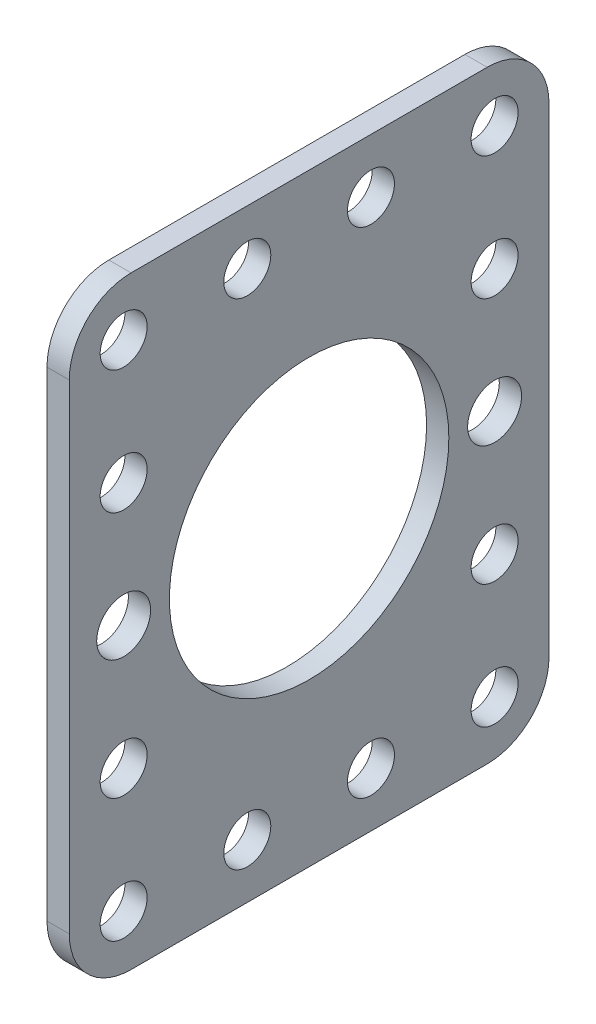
ISO-10303-21;
HEADER;
FILE_DESCRIPTION(('STEP AP214'),'2;1');
FILE_NAME('part.step','',(''),(''),'','','');
FILE_SCHEMA(('AUTOMOTIVE_DESIGN { 1 0 10303 214 1 1 1 1 }'));
ENDSEC;
DATA;
#1=APPLICATION_CONTEXT('core data for automotive mechanical design processes');
#2=APPLICATION_PROTOCOL_DEFINITION('international standard','automotive_design',2000,#1);
#3=PRODUCT_CONTEXT('',#1,'mechanical');
#4=PRODUCT('Part','Part','',(#3));
#5=PRODUCT_RELATED_PRODUCT_CATEGORY('part','',(#4));
#6=PRODUCT_DEFINITION_FORMATION('','',#4);
#7=PRODUCT_DEFINITION_CONTEXT('part definition',#1,'design');
#8=PRODUCT_DEFINITION('design','',#6,#7);
#9=PRODUCT_DEFINITION_SHAPE('','',#8);
#10=(LENGTH_UNIT() NAMED_UNIT(*) SI_UNIT(.MILLI.,.METRE.));
#11=(NAMED_UNIT(*) PLANE_ANGLE_UNIT() SI_UNIT($,.RADIAN.));
#12=(NAMED_UNIT(*) SI_UNIT($,.STERADIAN.) SOLID_ANGLE_UNIT());
#13=UNCERTAINTY_MEASURE_WITH_UNIT(LENGTH_MEASURE(1.E-05),#10,'distance_accuracy_value','');
#14=(GEOMETRIC_REPRESENTATION_CONTEXT(3) GLOBAL_UNCERTAINTY_ASSIGNED_CONTEXT((#13)) GLOBAL_UNIT_ASSIGNED_CONTEXT((#10,
#11,#12)) REPRESENTATION_CONTEXT('',''));
#15=CARTESIAN_POINT('',(0.,0.,0.));
#16=DIRECTION('',(0.,0.,1.));
#17=DIRECTION('',(1.,0.,0.));
#18=AXIS2_PLACEMENT_3D('',#15,#16,#17);
#19=CARTESIAN_POINT('',(2.28600000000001,-24.638,-18.288));
#20=DIRECTION('',(1.,0.,0.));
#21=DIRECTION('',(0.,0.,-1.));
#22=AXIS2_PLACEMENT_3D('',#19,#20,#21);
#23=PLANE('',#22);
#24=CARTESIAN_POINT('',(2.28599999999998,0.,19.05));
#25=DIRECTION('',(1.,0.,0.));
#26=DIRECTION('',(0.,0.,1.));
#27=AXIS2_PLACEMENT_3D('',#24,#25,#26);
#28=CIRCLE('',#27,2.7686);
#29=CARTESIAN_POINT('',(2.28599999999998,0.,21.8186));
#30=VERTEX_POINT('',#29);
#31=EDGE_CURVE('E268',#30,#30,#28,.T.);
#32=ORIENTED_EDGE('',*,*,#31,.F.);
#33=EDGE_LOOP('',(#32));
#34=FACE_BOUND('',#33,.T.);
#35=CARTESIAN_POINT('',(2.28600000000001,0.,-19.05));
#36=DIRECTION('',(1.,0.,0.));
#37=DIRECTION('',(0.,0.,-1.));
#38=AXIS2_PLACEMENT_3D('',#35,#36,#37);
#39=CIRCLE('',#38,2.7686);
#40=CARTESIAN_POINT('',(2.28600000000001,0.,-21.8186));
#41=VERTEX_POINT('',#40);
#42=EDGE_CURVE('E270',#41,#41,#39,.T.);
#43=ORIENTED_EDGE('',*,*,#42,.F.);
#44=EDGE_LOOP('',(#43));
#45=FACE_BOUND('',#44,.T.);
#46=CARTESIAN_POINT('',(2.28600000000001,25.4,-19.05));
#47=DIRECTION('',(1.,0.,0.));
#48=DIRECTION('',(0.,0.,-1.));
#49=AXIS2_PLACEMENT_3D('',#46,#47,#48);
#50=CIRCLE('',#49,2.413);
#51=CARTESIAN_POINT('',(2.28600000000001,25.4,-21.463));
#52=VERTEX_POINT('',#51);
#53=EDGE_CURVE('E281',#52,#52,#50,.T.);
#54=ORIENTED_EDGE('',*,*,#53,.F.);
#55=EDGE_LOOP('',(#54));
#56=FACE_BOUND('',#55,.T.);
#57=CARTESIAN_POINT('',(2.28599999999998,25.4,-6.35));
#58=DIRECTION('',(1.,0.,0.));
#59=DIRECTION('',(0.,0.,-1.));
#60=AXIS2_PLACEMENT_3D('',#57,#58,#59);
#61=CIRCLE('',#60,2.413);
#62=CARTESIAN_POINT('',(2.28599999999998,25.4,-8.763));
#63=VERTEX_POINT('',#62);
#64=EDGE_CURVE('E287',#63,#63,#61,.T.);
#65=ORIENTED_EDGE('',*,*,#64,.F.);
#66=EDGE_LOOP('',(#65));
#67=FACE_BOUND('',#66,.T.);
#68=CARTESIAN_POINT('',(2.28599999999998,25.4,6.35));
#69=DIRECTION('',(1.,0.,0.));
#70=DIRECTION('',(0.,0.,-1.));
#71=AXIS2_PLACEMENT_3D('',#68,#69,#70);
#72=CIRCLE('',#71,2.413);
#73=CARTESIAN_POINT('',(2.28599999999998,25.4,3.937));
#74=VERTEX_POINT('',#73);
#75=EDGE_CURVE('E293',#74,#74,#72,.T.);
#76=ORIENTED_EDGE('',*,*,#75,.F.);
#77=EDGE_LOOP('',(#76));
#78=FACE_BOUND('',#77,.T.);
#79=CARTESIAN_POINT('',(2.28600000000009,25.4,19.05));
#80=DIRECTION('',(1.,0.,0.));
#81=DIRECTION('',(0.,0.,-1.));
#82=AXIS2_PLACEMENT_3D('',#79,#80,#81);
#83=CIRCLE('',#82,2.413);
#84=CARTESIAN_POINT('',(2.28600000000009,25.4,16.637));
#85=VERTEX_POINT('',#84);
#86=EDGE_CURVE('E299',#85,#85,#83,.T.);
#87=ORIENTED_EDGE('',*,*,#86,.F.);
#88=EDGE_LOOP('',(#87));
#89=FACE_BOUND('',#88,.T.);
#90=CARTESIAN_POINT('',(2.28600000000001,12.7,-19.05));
#91=DIRECTION('',(1.,0.,0.));
#92=DIRECTION('',(0.,0.,-1.));
#93=AXIS2_PLACEMENT_3D('',#90,#91,#92);
#94=CIRCLE('',#93,2.413);
#95=CARTESIAN_POINT('',(2.28600000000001,12.7,-21.463));
#96=VERTEX_POINT('',#95);
#97=EDGE_CURVE('E305',#96,#96,#94,.T.);
#98=ORIENTED_EDGE('',*,*,#97,.F.);
#99=EDGE_LOOP('',(#98));
#100=FACE_BOUND('',#99,.T.);
#101=CARTESIAN_POINT('',(2.28599999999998,12.7,19.05));
#102=DIRECTION('',(1.,0.,0.));
#103=DIRECTION('',(0.,0.,-1.));
#104=AXIS2_PLACEMENT_3D('',#101,#102,#103);
#105=CIRCLE('',#104,2.413);
#106=CARTESIAN_POINT('',(2.28599999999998,12.7,16.637));
#107=VERTEX_POINT('',#106);
#108=EDGE_CURVE('E311',#107,#107,#105,.T.);
#109=ORIENTED_EDGE('',*,*,#108,.F.);
#110=EDGE_LOOP('',(#109));
#111=FACE_BOUND('',#110,.T.);
#112=CARTESIAN_POINT('',(2.28600000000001,-12.7,-19.05));
#113=DIRECTION('',(1.,0.,0.));
#114=DIRECTION('',(0.,0.,-1.));
#115=AXIS2_PLACEMENT_3D('',#112,#113,#114);
#116=CIRCLE('',#115,2.413);
#117=CARTESIAN_POINT('',(2.28600000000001,-12.7,-21.463));
#118=VERTEX_POINT('',#117);
#119=EDGE_CURVE('E317',#118,#118,#116,.T.);
#120=ORIENTED_EDGE('',*,*,#119,.F.);
#121=EDGE_LOOP('',(#120));
#122=FACE_BOUND('',#121,.T.);
#123=CARTESIAN_POINT('',(2.28600000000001,-12.7,19.05));
#124=DIRECTION('',(1.,0.,0.));
#125=DIRECTION('',(0.,0.,-1.));
#126=AXIS2_PLACEMENT_3D('',#123,#124,#125);
#127=CIRCLE('',#126,2.413);
#128=CARTESIAN_POINT('',(2.28600000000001,-12.7,16.637));
#129=VERTEX_POINT('',#128);
#130=EDGE_CURVE('E323',#129,#129,#127,.T.);
#131=ORIENTED_EDGE('',*,*,#130,.F.);
#132=EDGE_LOOP('',(#131));
#133=FACE_BOUND('',#132,.T.);
#134=CARTESIAN_POINT('',(2.28600000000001,-25.4,-19.05));
#135=DIRECTION('',(1.,0.,0.));
#136=DIRECTION('',(0.,0.,-1.));
#137=AXIS2_PLACEMENT_3D('',#134,#135,#136);
#138=CIRCLE('',#137,2.413);
#139=CARTESIAN_POINT('',(2.28600000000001,-25.4,-21.463));
#140=VERTEX_POINT('',#139);
#141=EDGE_CURVE('E329',#140,#140,#138,.T.);
#142=ORIENTED_EDGE('',*,*,#141,.F.);
#143=EDGE_LOOP('',(#142));
#144=FACE_BOUND('',#143,.T.);
#145=CARTESIAN_POINT('',(2.28600000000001,-25.4,-6.35));
#146=DIRECTION('',(1.,0.,0.));
#147=DIRECTION('',(0.,0.,-1.));
#148=AXIS2_PLACEMENT_3D('',#145,#146,#147);
#149=CIRCLE('',#148,2.413);
#150=CARTESIAN_POINT('',(2.28600000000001,-25.4,-8.763));
#151=VERTEX_POINT('',#150);
#152=EDGE_CURVE('E335',#151,#151,#149,.T.);
#153=ORIENTED_EDGE('',*,*,#152,.F.);
#154=EDGE_LOOP('',(#153));
#155=FACE_BOUND('',#154,.T.);
#156=CARTESIAN_POINT('',(2.28600000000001,-25.4,6.35));
#157=DIRECTION('',(1.,0.,0.));
#158=DIRECTION('',(0.,0.,-1.));
#159=AXIS2_PLACEMENT_3D('',#156,#157,#158);
#160=CIRCLE('',#159,2.413);
#161=CARTESIAN_POINT('',(2.28600000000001,-25.4,3.937));
#162=VERTEX_POINT('',#161);
#163=EDGE_CURVE('E341',#162,#162,#160,.T.);
#164=ORIENTED_EDGE('',*,*,#163,.F.);
#165=EDGE_LOOP('',(#164));
#166=FACE_BOUND('',#165,.T.);
#167=CARTESIAN_POINT('',(2.28600000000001,-25.4,19.05));
#168=DIRECTION('',(1.,0.,0.));
#169=DIRECTION('',(0.,0.,-1.));
#170=AXIS2_PLACEMENT_3D('',#167,#168,#169);
#171=CIRCLE('',#170,2.413);
#172=CARTESIAN_POINT('',(2.28600000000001,-25.4,16.637));
#173=VERTEX_POINT('',#172);
#174=EDGE_CURVE('E344',#173,#173,#171,.T.);
#175=ORIENTED_EDGE('',*,*,#174,.F.);
#176=EDGE_LOOP('',(#175));
#177=FACE_BOUND('',#176,.T.);
#178=CARTESIAN_POINT('',(2.28600000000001,-24.638,-18.288));
#179=DIRECTION('',(1.,0.,0.));
#180=DIRECTION('',(0.,0.,-1.));
#181=AXIS2_PLACEMENT_3D('',#178,#179,#180);
#182=CIRCLE('',#181,6.35);
#183=CARTESIAN_POINT('',(2.28600000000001,-30.988,-18.288));
#184=VERTEX_POINT('',#183);
#185=CARTESIAN_POINT('',(2.28600000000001,-24.638,-24.638));
#186=VERTEX_POINT('',#185);
#187=EDGE_CURVE('E133',#184,#186,#182,.T.);
#188=ORIENTED_EDGE('',*,*,#187,.T.);
#189=DIRECTION('',(0.,1.,0.));
#190=VECTOR('',#189,1.);
#191=CARTESIAN_POINT('',(2.28600000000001,-24.638,-24.638));
#192=LINE('',#191,#190);
#193=CARTESIAN_POINT('',(2.28600000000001,24.638,-24.638));
#194=VERTEX_POINT('',#193);
#195=EDGE_CURVE('E110',#186,#194,#192,.T.);
#196=ORIENTED_EDGE('',*,*,#195,.T.);
#197=CARTESIAN_POINT('',(2.28600000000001,24.638,-18.288));
#198=DIRECTION('',(1.,0.,0.));
#199=DIRECTION('',(0.,0.,1.));
#200=AXIS2_PLACEMENT_3D('',#197,#198,#199);
#201=CIRCLE('',#200,6.35);
#202=CARTESIAN_POINT('',(2.28599999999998,30.988,-18.288));
#203=VERTEX_POINT('',#202);
#204=EDGE_CURVE('E136',#194,#203,#201,.T.);
#205=ORIENTED_EDGE('',*,*,#204,.T.);
#206=DIRECTION('',(0.,0.,1.));
#207=VECTOR('',#206,1.);
#208=CARTESIAN_POINT('',(2.28600000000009,30.988,18.288));
#209=LINE('',#208,#207);
#210=CARTESIAN_POINT('',(2.28600000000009,30.988,18.288));
#211=VERTEX_POINT('',#210);
#212=EDGE_CURVE('E138',#203,#211,#209,.T.);
#213=ORIENTED_EDGE('',*,*,#212,.T.);
#214=CARTESIAN_POINT('',(2.28600000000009,24.638,18.288));
#215=DIRECTION('',(1.,0.,0.));
#216=DIRECTION('',(0.,0.,1.));
#217=AXIS2_PLACEMENT_3D('',#214,#215,#216);
#218=CIRCLE('',#217,6.35);
#219=CARTESIAN_POINT('',(2.28600000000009,24.638,24.638));
#220=VERTEX_POINT('',#219);
#221=EDGE_CURVE('E140',#211,#220,#218,.T.);
#222=ORIENTED_EDGE('',*,*,#221,.T.);
#223=DIRECTION('',(0.,-1.,0.));
#224=VECTOR('',#223,1.);
#225=CARTESIAN_POINT('',(2.28600000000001,-24.638,24.638));
#226=LINE('',#225,#224);
#227=CARTESIAN_POINT('',(2.28600000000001,-24.638,24.638));
#228=VERTEX_POINT('',#227);
#229=EDGE_CURVE('E142',#220,#228,#226,.T.);
#230=ORIENTED_EDGE('',*,*,#229,.T.);
#231=CARTESIAN_POINT('',(2.28600000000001,-24.638,18.288));
#232=DIRECTION('',(1.,0.,0.));
#233=DIRECTION('',(0.,0.,1.));
#234=AXIS2_PLACEMENT_3D('',#231,#232,#233);
#235=CIRCLE('',#234,6.35);
#236=CARTESIAN_POINT('',(2.28600000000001,-30.988,18.288));
#237=VERTEX_POINT('',#236);
#238=EDGE_CURVE('E51',#228,#237,#235,.T.);
#239=ORIENTED_EDGE('',*,*,#238,.T.);
#240=DIRECTION('',(0.,0.,-1.));
#241=VECTOR('',#240,1.);
#242=CARTESIAN_POINT('',(2.28600000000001,-30.988,18.288));
#243=LINE('',#242,#241);
#244=EDGE_CURVE('E46',#237,#184,#243,.T.);
#245=ORIENTED_EDGE('',*,*,#244,.T.);
#246=EDGE_LOOP('',(#188,#196,#205,#213,#222,#230,#239,#245));
#247=FACE_BOUND('',#246,.T.);
#248=CARTESIAN_POINT('',(2.28600000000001,0.,0.));
#249=DIRECTION('',(1.,0.,0.));
#250=DIRECTION('',(0.,0.,-1.));
#251=AXIS2_PLACEMENT_3D('',#248,#249,#250);
#252=CIRCLE('',#251,14.351);
#253=CARTESIAN_POINT('',(2.28600000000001,0.,-14.351));
#254=VERTEX_POINT('',#253);
#255=EDGE_CURVE('E115',#254,#254,#252,.T.);
#256=ORIENTED_EDGE('',*,*,#255,.F.);
#257=EDGE_LOOP('',(#256));
#258=FACE_BOUND('',#257,.T.);
#259=ADVANCED_FACE('F31',(#34,#45,#56,#67,#78,#89,#100,#111,#122,#133,#144,#155,#166,#177,#247,
#258),#23,.T.);
#260=CARTESIAN_POINT('',(0.,-24.638,-18.288));
#261=DIRECTION('',(1.,0.,0.));
#262=DIRECTION('',(0.,0.,-1.));
#263=AXIS2_PLACEMENT_3D('',#260,#261,#262);
#264=PLANE('',#263);
#265=CARTESIAN_POINT('',(0.,0.,19.05));
#266=DIRECTION('',(1.,0.,0.));
#267=DIRECTION('',(0.,0.,1.));
#268=AXIS2_PLACEMENT_3D('',#265,#266,#267);
#269=CIRCLE('',#268,2.7686);
#270=CARTESIAN_POINT('',(0.,0.,21.8186));
#271=VERTEX_POINT('',#270);
#272=EDGE_CURVE('E266',#271,#271,#269,.T.);
#273=ORIENTED_EDGE('',*,*,#272,.T.);
#274=EDGE_LOOP('',(#273));
#275=FACE_BOUND('',#274,.T.);
#276=CARTESIAN_POINT('',(0.,0.,-19.05));
#277=DIRECTION('',(1.,0.,0.));
#278=DIRECTION('',(0.,0.,-1.));
#279=AXIS2_PLACEMENT_3D('',#276,#277,#278);
#280=CIRCLE('',#279,2.7686);
#281=CARTESIAN_POINT('',(0.,0.,-21.8186));
#282=VERTEX_POINT('',#281);
#283=EDGE_CURVE('E275',#282,#282,#280,.T.);
#284=ORIENTED_EDGE('',*,*,#283,.T.);
#285=EDGE_LOOP('',(#284));
#286=FACE_BOUND('',#285,.T.);
#287=CARTESIAN_POINT('',(0.,25.4,-19.05));
#288=DIRECTION('',(1.,0.,0.));
#289=DIRECTION('',(0.,0.,-1.));
#290=AXIS2_PLACEMENT_3D('',#287,#288,#289);
#291=CIRCLE('',#290,2.413);
#292=CARTESIAN_POINT('',(0.,25.4,-21.463));
#293=VERTEX_POINT('',#292);
#294=EDGE_CURVE('E278',#293,#293,#291,.T.);
#295=ORIENTED_EDGE('',*,*,#294,.T.);
#296=EDGE_LOOP('',(#295));
#297=FACE_BOUND('',#296,.T.);
#298=CARTESIAN_POINT('',(0.,25.4,-6.35));
#299=DIRECTION('',(1.,0.,0.));
#300=DIRECTION('',(0.,0.,-1.));
#301=AXIS2_PLACEMENT_3D('',#298,#299,#300);
#302=CIRCLE('',#301,2.413);
#303=CARTESIAN_POINT('',(0.,25.4,-8.763));
#304=VERTEX_POINT('',#303);
#305=EDGE_CURVE('E284',#304,#304,#302,.T.);
#306=ORIENTED_EDGE('',*,*,#305,.T.);
#307=EDGE_LOOP('',(#306));
#308=FACE_BOUND('',#307,.T.);
#309=CARTESIAN_POINT('',(0.,25.4,6.35));
#310=DIRECTION('',(1.,0.,0.));
#311=DIRECTION('',(0.,0.,-1.));
#312=AXIS2_PLACEMENT_3D('',#309,#310,#311);
#313=CIRCLE('',#312,2.413);
#314=CARTESIAN_POINT('',(0.,25.4,3.937));
#315=VERTEX_POINT('',#314);
#316=EDGE_CURVE('E290',#315,#315,#313,.T.);
#317=ORIENTED_EDGE('',*,*,#316,.T.);
#318=EDGE_LOOP('',(#317));
#319=FACE_BOUND('',#318,.T.);
#320=CARTESIAN_POINT('',(1.11022302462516E-13,25.4,19.05));
#321=DIRECTION('',(1.,0.,0.));
#322=DIRECTION('',(0.,0.,-1.));
#323=AXIS2_PLACEMENT_3D('',#320,#321,#322);
#324=CIRCLE('',#323,2.413);
#325=CARTESIAN_POINT('',(1.11022302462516E-13,25.4,16.637));
#326=VERTEX_POINT('',#325);
#327=EDGE_CURVE('E296',#326,#326,#324,.T.);
#328=ORIENTED_EDGE('',*,*,#327,.T.);
#329=EDGE_LOOP('',(#328));
#330=FACE_BOUND('',#329,.T.);
#331=CARTESIAN_POINT('',(0.,12.7,-19.05));
#332=DIRECTION('',(1.,0.,0.));
#333=DIRECTION('',(0.,0.,-1.));
#334=AXIS2_PLACEMENT_3D('',#331,#332,#333);
#335=CIRCLE('',#334,2.413);
#336=CARTESIAN_POINT('',(0.,12.7,-21.463));
#337=VERTEX_POINT('',#336);
#338=EDGE_CURVE('E302',#337,#337,#335,.T.);
#339=ORIENTED_EDGE('',*,*,#338,.T.);
#340=EDGE_LOOP('',(#339));
#341=FACE_BOUND('',#340,.T.);
#342=CARTESIAN_POINT('',(0.,12.7,19.05));
#343=DIRECTION('',(1.,0.,0.));
#344=DIRECTION('',(0.,0.,-1.));
#345=AXIS2_PLACEMENT_3D('',#342,#343,#344);
#346=CIRCLE('',#345,2.413);
#347=CARTESIAN_POINT('',(0.,12.7,16.637));
#348=VERTEX_POINT('',#347);
#349=EDGE_CURVE('E308',#348,#348,#346,.T.);
#350=ORIENTED_EDGE('',*,*,#349,.T.);
#351=EDGE_LOOP('',(#350));
#352=FACE_BOUND('',#351,.T.);
#353=CARTESIAN_POINT('',(0.,-12.7,-19.05));
#354=DIRECTION('',(1.,0.,0.));
#355=DIRECTION('',(0.,0.,-1.));
#356=AXIS2_PLACEMENT_3D('',#353,#354,#355);
#357=CIRCLE('',#356,2.413);
#358=CARTESIAN_POINT('',(0.,-12.7,-21.463));
#359=VERTEX_POINT('',#358);
#360=EDGE_CURVE('E314',#359,#359,#357,.T.);
#361=ORIENTED_EDGE('',*,*,#360,.T.);
#362=EDGE_LOOP('',(#361));
#363=FACE_BOUND('',#362,.T.);
#364=CARTESIAN_POINT('',(0.,-12.7,19.05));
#365=DIRECTION('',(1.,0.,0.));
#366=DIRECTION('',(0.,0.,-1.));
#367=AXIS2_PLACEMENT_3D('',#364,#365,#366);
#368=CIRCLE('',#367,2.413);
#369=CARTESIAN_POINT('',(0.,-12.7,16.637));
#370=VERTEX_POINT('',#369);
#371=EDGE_CURVE('E320',#370,#370,#368,.T.);
#372=ORIENTED_EDGE('',*,*,#371,.T.);
#373=EDGE_LOOP('',(#372));
#374=FACE_BOUND('',#373,.T.);
#375=CARTESIAN_POINT('',(0.,-25.4,-19.05));
#376=DIRECTION('',(1.,0.,0.));
#377=DIRECTION('',(0.,0.,-1.));
#378=AXIS2_PLACEMENT_3D('',#375,#376,#377);
#379=CIRCLE('',#378,2.413);
#380=CARTESIAN_POINT('',(0.,-25.4,-21.463));
#381=VERTEX_POINT('',#380);
#382=EDGE_CURVE('E326',#381,#381,#379,.T.);
#383=ORIENTED_EDGE('',*,*,#382,.T.);
#384=EDGE_LOOP('',(#383));
#385=FACE_BOUND('',#384,.T.);
#386=CARTESIAN_POINT('',(0.,-25.4,-6.35));
#387=DIRECTION('',(1.,0.,0.));
#388=DIRECTION('',(0.,0.,-1.));
#389=AXIS2_PLACEMENT_3D('',#386,#387,#388);
#390=CIRCLE('',#389,2.413);
#391=CARTESIAN_POINT('',(0.,-25.4,-8.763));
#392=VERTEX_POINT('',#391);
#393=EDGE_CURVE('E332',#392,#392,#390,.T.);
#394=ORIENTED_EDGE('',*,*,#393,.T.);
#395=EDGE_LOOP('',(#394));
#396=FACE_BOUND('',#395,.T.);
#397=CARTESIAN_POINT('',(0.,-25.4,6.35));
#398=DIRECTION('',(1.,0.,0.));
#399=DIRECTION('',(0.,0.,-1.));
#400=AXIS2_PLACEMENT_3D('',#397,#398,#399);
#401=CIRCLE('',#400,2.413);
#402=CARTESIAN_POINT('',(0.,-25.4,3.937));
#403=VERTEX_POINT('',#402);
#404=EDGE_CURVE('E338',#403,#403,#401,.T.);
#405=ORIENTED_EDGE('',*,*,#404,.T.);
#406=EDGE_LOOP('',(#405));
#407=FACE_BOUND('',#406,.T.);
#408=CARTESIAN_POINT('',(0.,-25.4,19.05));
#409=DIRECTION('',(1.,0.,0.));
#410=DIRECTION('',(0.,0.,-1.));
#411=AXIS2_PLACEMENT_3D('',#408,#409,#410);
#412=CIRCLE('',#411,2.413);
#413=CARTESIAN_POINT('',(0.,-25.4,16.637));
#414=VERTEX_POINT('',#413);
#415=EDGE_CURVE('E347',#414,#414,#412,.T.);
#416=ORIENTED_EDGE('',*,*,#415,.T.);
#417=EDGE_LOOP('',(#416));
#418=FACE_BOUND('',#417,.T.);
#419=CARTESIAN_POINT('',(0.,-24.638,-18.288));
#420=DIRECTION('',(1.,0.,0.));
#421=DIRECTION('',(0.,0.,-1.));
#422=AXIS2_PLACEMENT_3D('',#419,#420,#421);
#423=CIRCLE('',#422,6.35);
#424=CARTESIAN_POINT('',(0.,-30.988,-18.288));
#425=VERTEX_POINT('',#424);
#426=CARTESIAN_POINT('',(0.,-24.638,-24.638));
#427=VERTEX_POINT('',#426);
#428=EDGE_CURVE('E101',#425,#427,#423,.T.);
#429=ORIENTED_EDGE('',*,*,#428,.F.);
#430=DIRECTION('',(0.,0.,-1.));
#431=VECTOR('',#430,1.);
#432=CARTESIAN_POINT('',(0.,-30.988,18.288));
#433=LINE('',#432,#431);
#434=CARTESIAN_POINT('',(0.,-30.988,18.288));
#435=VERTEX_POINT('',#434);
#436=EDGE_CURVE('E131',#435,#425,#433,.T.);
#437=ORIENTED_EDGE('',*,*,#436,.F.);
#438=CARTESIAN_POINT('',(0.,-24.638,18.288));
#439=DIRECTION('',(1.,0.,0.));
#440=DIRECTION('',(0.,0.,1.));
#441=AXIS2_PLACEMENT_3D('',#438,#439,#440);
#442=CIRCLE('',#441,6.35);
#443=CARTESIAN_POINT('',(0.,-24.638,24.638));
#444=VERTEX_POINT('',#443);
#445=EDGE_CURVE('E129',#444,#435,#442,.T.);
#446=ORIENTED_EDGE('',*,*,#445,.F.);
#447=DIRECTION('',(0.,-1.,0.));
#448=VECTOR('',#447,1.);
#449=CARTESIAN_POINT('',(0.,-24.638,24.638));
#450=LINE('',#449,#448);
#451=CARTESIAN_POINT('',(1.11022302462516E-13,24.638,24.638));
#452=VERTEX_POINT('',#451);
#453=EDGE_CURVE('E127',#452,#444,#450,.T.);
#454=ORIENTED_EDGE('',*,*,#453,.F.);
#455=CARTESIAN_POINT('',(1.11022302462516E-13,24.638,18.288));
#456=DIRECTION('',(1.,0.,0.));
#457=DIRECTION('',(0.,0.,1.));
#458=AXIS2_PLACEMENT_3D('',#455,#456,#457);
#459=CIRCLE('',#458,6.35);
#460=CARTESIAN_POINT('',(1.11022302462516E-13,30.988,18.288));
#461=VERTEX_POINT('',#460);
#462=EDGE_CURVE('E125',#461,#452,#459,.T.);
#463=ORIENTED_EDGE('',*,*,#462,.F.);
#464=DIRECTION('',(0.,0.,1.));
#465=VECTOR('',#464,1.);
#466=CARTESIAN_POINT('',(1.11022302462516E-13,30.988,18.288));
#467=LINE('',#466,#465);
#468=CARTESIAN_POINT('',(0.,30.988,-18.288));
#469=VERTEX_POINT('',#468);
#470=EDGE_CURVE('E123',#469,#461,#467,.T.);
#471=ORIENTED_EDGE('',*,*,#470,.F.);
#472=CARTESIAN_POINT('',(0.,24.638,-18.288));
#473=DIRECTION('',(1.,0.,0.));
#474=DIRECTION('',(0.,0.,1.));
#475=AXIS2_PLACEMENT_3D('',#472,#473,#474);
#476=CIRCLE('',#475,6.35);
#477=CARTESIAN_POINT('',(0.,24.638,-24.638));
#478=VERTEX_POINT('',#477);
#479=EDGE_CURVE('E103',#478,#469,#476,.T.);
#480=ORIENTED_EDGE('',*,*,#479,.F.);
#481=DIRECTION('',(0.,1.,0.));
#482=VECTOR('',#481,1.);
#483=CARTESIAN_POINT('',(0.,-24.638,-24.638));
#484=LINE('',#483,#482);
#485=EDGE_CURVE('E96',#427,#478,#484,.T.);
#486=ORIENTED_EDGE('',*,*,#485,.F.);
#487=EDGE_LOOP('',(#429,#437,#446,#454,#463,#471,#480,#486));
#488=FACE_BOUND('',#487,.T.);
#489=CARTESIAN_POINT('',(0.,0.,0.));
#490=DIRECTION('',(1.,0.,0.));
#491=DIRECTION('',(0.,0.,-1.));
#492=AXIS2_PLACEMENT_3D('',#489,#490,#491);
#493=CIRCLE('',#492,14.351);
#494=CARTESIAN_POINT('',(0.,0.,-14.351));
#495=VERTEX_POINT('',#494);
#496=EDGE_CURVE('E118',#495,#495,#493,.T.);
#497=ORIENTED_EDGE('',*,*,#496,.T.);
#498=EDGE_LOOP('',(#497));
#499=FACE_BOUND('',#498,.T.);
#500=ADVANCED_FACE('F97',(#275,#286,#297,#308,#319,#330,#341,#352,#363,#374,#385,#396,#407,#418,
#488,#499),#264,.F.);
#501=CARTESIAN_POINT('',(2.28600000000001,-24.638,-18.288));
#502=DIRECTION('',(-1.,0.,0.));
#503=DIRECTION('',(0.,0.,1.));
#504=AXIS2_PLACEMENT_3D('',#501,#502,#503);
#505=CYLINDRICAL_SURFACE('',#504,6.35);
#506=ORIENTED_EDGE('',*,*,#428,.T.);
#507=DIRECTION('',(-1.,0.,0.));
#508=VECTOR('',#507,1.);
#509=CARTESIAN_POINT('',(2.28600000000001,-24.638,-24.638));
#510=LINE('',#509,#508);
#511=EDGE_CURVE('E11',#186,#427,#510,.T.);
#512=ORIENTED_EDGE('',*,*,#511,.F.);
#513=ORIENTED_EDGE('',*,*,#187,.F.);
#514=DIRECTION('',(-1.,0.,0.));
#515=VECTOR('',#514,1.);
#516=CARTESIAN_POINT('',(2.28600000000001,-30.988,-18.288));
#517=LINE('',#516,#515);
#518=EDGE_CURVE('E114',#184,#425,#517,.T.);
#519=ORIENTED_EDGE('',*,*,#518,.T.);
#520=EDGE_LOOP('',(#506,#512,#513,#519));
#521=FACE_BOUND('',#520,.T.);
#522=ADVANCED_FACE('F33',(#521),#505,.T.);
#523=CARTESIAN_POINT('',(2.28600000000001,-24.638,-24.638));
#524=DIRECTION('',(0.,0.,1.));
#525=DIRECTION('',(1.,0.,0.));
#526=AXIS2_PLACEMENT_3D('',#523,#524,#525);
#527=PLANE('',#526);
#528=ORIENTED_EDGE('',*,*,#485,.T.);
#529=DIRECTION('',(-1.,0.,0.));
#530=VECTOR('',#529,1.);
#531=CARTESIAN_POINT('',(2.28600000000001,24.638,-24.638));
#532=LINE('',#531,#530);
#533=EDGE_CURVE('E39',#194,#478,#532,.T.);
#534=ORIENTED_EDGE('',*,*,#533,.F.);
#535=ORIENTED_EDGE('',*,*,#195,.F.);
#536=ORIENTED_EDGE('',*,*,#511,.T.);
#537=EDGE_LOOP('',(#528,#534,#535,#536));
#538=FACE_BOUND('',#537,.T.);
#539=ADVANCED_FACE('F109',(#538),#527,.F.);
#540=CARTESIAN_POINT('',(2.28600000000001,24.638,-18.288));
#541=DIRECTION('',(-1.,0.,0.));
#542=DIRECTION('',(0.,0.,1.));
#543=AXIS2_PLACEMENT_3D('',#540,#541,#542);
#544=CYLINDRICAL_SURFACE('',#543,6.35);
#545=ORIENTED_EDGE('',*,*,#479,.T.);
#546=DIRECTION('',(-1.,0.,0.));
#547=VECTOR('',#546,1.);
#548=CARTESIAN_POINT('',(2.28599999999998,30.988,-18.288));
#549=LINE('',#548,#547);
#550=EDGE_CURVE('E159',#203,#469,#549,.T.);
#551=ORIENTED_EDGE('',*,*,#550,.F.);
#552=ORIENTED_EDGE('',*,*,#204,.F.);
#553=ORIENTED_EDGE('',*,*,#533,.T.);
#554=EDGE_LOOP('',(#545,#551,#552,#553));
#555=FACE_BOUND('',#554,.T.);
#556=ADVANCED_FACE('F163',(#555),#544,.T.);
#557=CARTESIAN_POINT('',(2.28600000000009,30.988,18.288));
#558=DIRECTION('',(0.,-1.,0.));
#559=DIRECTION('',(0.,0.,-1.));
#560=AXIS2_PLACEMENT_3D('',#557,#558,#559);
#561=PLANE('',#560);
#562=ORIENTED_EDGE('',*,*,#470,.T.);
#563=DIRECTION('',(-1.,0.,0.));
#564=VECTOR('',#563,1.);
#565=CARTESIAN_POINT('',(2.28600000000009,30.988,18.288));
#566=LINE('',#565,#564);
#567=EDGE_CURVE('E156',#211,#461,#566,.T.);
#568=ORIENTED_EDGE('',*,*,#567,.F.);
#569=ORIENTED_EDGE('',*,*,#212,.F.);
#570=ORIENTED_EDGE('',*,*,#550,.T.);
#571=EDGE_LOOP('',(#562,#568,#569,#570));
#572=FACE_BOUND('',#571,.T.);
#573=ADVANCED_FACE('F171',(#572),#561,.F.);
#574=CARTESIAN_POINT('',(2.28600000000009,24.638,18.288));
#575=DIRECTION('',(-1.,0.,0.));
#576=DIRECTION('',(0.,0.,1.));
#577=AXIS2_PLACEMENT_3D('',#574,#575,#576);
#578=CYLINDRICAL_SURFACE('',#577,6.35);
#579=ORIENTED_EDGE('',*,*,#462,.T.);
#580=DIRECTION('',(-1.,0.,0.));
#581=VECTOR('',#580,1.);
#582=CARTESIAN_POINT('',(2.28600000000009,24.638,24.638));
#583=LINE('',#582,#581);
#584=EDGE_CURVE('E153',#220,#452,#583,.T.);
#585=ORIENTED_EDGE('',*,*,#584,.F.);
#586=ORIENTED_EDGE('',*,*,#221,.F.);
#587=ORIENTED_EDGE('',*,*,#567,.T.);
#588=EDGE_LOOP('',(#579,#585,#586,#587));
#589=FACE_BOUND('',#588,.T.);
#590=ADVANCED_FACE('F174',(#589),#578,.T.);
#591=CARTESIAN_POINT('',(2.28600000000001,-24.638,24.638));
#592=DIRECTION('',(0.,0.,-1.));
#593=DIRECTION('',(-1.,0.,0.));
#594=AXIS2_PLACEMENT_3D('',#591,#592,#593);
#595=PLANE('',#594);
#596=ORIENTED_EDGE('',*,*,#453,.T.);
#597=DIRECTION('',(-1.,0.,0.));
#598=VECTOR('',#597,1.);
#599=CARTESIAN_POINT('',(2.28600000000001,-24.638,24.638));
#600=LINE('',#599,#598);
#601=EDGE_CURVE('E150',#228,#444,#600,.T.);
#602=ORIENTED_EDGE('',*,*,#601,.F.);
#603=ORIENTED_EDGE('',*,*,#229,.F.);
#604=ORIENTED_EDGE('',*,*,#584,.T.);
#605=EDGE_LOOP('',(#596,#602,#603,#604));
#606=FACE_BOUND('',#605,.T.);
#607=ADVANCED_FACE('F179',(#606),#595,.F.);
#608=CARTESIAN_POINT('',(2.28600000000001,-24.638,18.288));
#609=DIRECTION('',(-1.,0.,0.));
#610=DIRECTION('',(0.,0.,1.));
#611=AXIS2_PLACEMENT_3D('',#608,#609,#610);
#612=CYLINDRICAL_SURFACE('',#611,6.35);
#613=ORIENTED_EDGE('',*,*,#445,.T.);
#614=DIRECTION('',(-1.,0.,0.));
#615=VECTOR('',#614,1.);
#616=CARTESIAN_POINT('',(2.28600000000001,-30.988,18.288));
#617=LINE('',#616,#615);
#618=EDGE_CURVE('E147',#237,#435,#617,.T.);
#619=ORIENTED_EDGE('',*,*,#618,.F.);
#620=ORIENTED_EDGE('',*,*,#238,.F.);
#621=ORIENTED_EDGE('',*,*,#601,.T.);
#622=EDGE_LOOP('',(#613,#619,#620,#621));
#623=FACE_BOUND('',#622,.T.);
#624=ADVANCED_FACE('F182',(#623),#612,.T.);
#625=CARTESIAN_POINT('',(2.28600000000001,-30.988,18.288));
#626=DIRECTION('',(0.,1.,0.));
#627=DIRECTION('',(0.,0.,1.));
#628=AXIS2_PLACEMENT_3D('',#625,#626,#627);
#629=PLANE('',#628);
#630=ORIENTED_EDGE('',*,*,#436,.T.);
#631=ORIENTED_EDGE('',*,*,#518,.F.);
#632=ORIENTED_EDGE('',*,*,#244,.F.);
#633=ORIENTED_EDGE('',*,*,#618,.T.);
#634=EDGE_LOOP('',(#630,#631,#632,#633));
#635=FACE_BOUND('',#634,.T.);
#636=ADVANCED_FACE('F184',(#635),#629,.F.);
#637=CARTESIAN_POINT('',(2.28600000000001,0.,0.));
#638=DIRECTION('',(-1.,0.,0.));
#639=DIRECTION('',(0.,0.,1.));
#640=AXIS2_PLACEMENT_3D('',#637,#638,#639);
#641=CYLINDRICAL_SURFACE('',#640,14.351);
#642=ORIENTED_EDGE('',*,*,#255,.T.);
#643=EDGE_LOOP('',(#642));
#644=FACE_BOUND('',#643,.T.);
#645=ORIENTED_EDGE('',*,*,#496,.F.);
#646=EDGE_LOOP('',(#645));
#647=FACE_BOUND('',#646,.T.);
#648=ADVANCED_FACE('F186',(#644,#647),#641,.F.);
#649=CARTESIAN_POINT('',(0.,-25.4,19.05));
#650=DIRECTION('',(1.,0.,0.));
#651=DIRECTION('',(0.,0.,-1.));
#652=AXIS2_PLACEMENT_3D('',#649,#650,#651);
#653=CYLINDRICAL_SURFACE('',#652,2.413);
#654=ORIENTED_EDGE('',*,*,#415,.F.);
#655=EDGE_LOOP('',(#654));
#656=FACE_BOUND('',#655,.T.);
#657=ORIENTED_EDGE('',*,*,#174,.T.);
#658=EDGE_LOOP('',(#657));
#659=FACE_BOUND('',#658,.T.);
#660=ADVANCED_FACE('F192',(#656,#659),#653,.F.);
#661=CARTESIAN_POINT('',(0.,-25.4,6.35));
#662=DIRECTION('',(1.,0.,0.));
#663=DIRECTION('',(0.,0.,-1.));
#664=AXIS2_PLACEMENT_3D('',#661,#662,#663);
#665=CYLINDRICAL_SURFACE('',#664,2.413);
#666=ORIENTED_EDGE('',*,*,#404,.F.);
#667=EDGE_LOOP('',(#666));
#668=FACE_BOUND('',#667,.T.);
#669=ORIENTED_EDGE('',*,*,#163,.T.);
#670=EDGE_LOOP('',(#669));
#671=FACE_BOUND('',#670,.T.);
#672=ADVANCED_FACE('F209',(#668,#671),#665,.F.);
#673=CARTESIAN_POINT('',(0.,-25.4,-6.35));
#674=DIRECTION('',(1.,0.,0.));
#675=DIRECTION('',(0.,0.,-1.));
#676=AXIS2_PLACEMENT_3D('',#673,#674,#675);
#677=CYLINDRICAL_SURFACE('',#676,2.413);
#678=ORIENTED_EDGE('',*,*,#393,.F.);
#679=EDGE_LOOP('',(#678));
#680=FACE_BOUND('',#679,.T.);
#681=ORIENTED_EDGE('',*,*,#152,.T.);
#682=EDGE_LOOP('',(#681));
#683=FACE_BOUND('',#682,.T.);
#684=ADVANCED_FACE('F213',(#680,#683),#677,.F.);
#685=CARTESIAN_POINT('',(0.,-25.4,-19.05));
#686=DIRECTION('',(1.,0.,0.));
#687=DIRECTION('',(0.,0.,-1.));
#688=AXIS2_PLACEMENT_3D('',#685,#686,#687);
#689=CYLINDRICAL_SURFACE('',#688,2.413);
#690=ORIENTED_EDGE('',*,*,#382,.F.);
#691=EDGE_LOOP('',(#690));
#692=FACE_BOUND('',#691,.T.);
#693=ORIENTED_EDGE('',*,*,#141,.T.);
#694=EDGE_LOOP('',(#693));
#695=FACE_BOUND('',#694,.T.);
#696=ADVANCED_FACE('F217',(#692,#695),#689,.F.);
#697=CARTESIAN_POINT('',(0.,-12.7,19.05));
#698=DIRECTION('',(1.,0.,0.));
#699=DIRECTION('',(0.,0.,-1.));
#700=AXIS2_PLACEMENT_3D('',#697,#698,#699);
#701=CYLINDRICAL_SURFACE('',#700,2.413);
#702=ORIENTED_EDGE('',*,*,#371,.F.);
#703=EDGE_LOOP('',(#702));
#704=FACE_BOUND('',#703,.T.);
#705=ORIENTED_EDGE('',*,*,#130,.T.);
#706=EDGE_LOOP('',(#705));
#707=FACE_BOUND('',#706,.T.);
#708=ADVANCED_FACE('F221',(#704,#707),#701,.F.);
#709=CARTESIAN_POINT('',(0.,-12.7,-19.05));
#710=DIRECTION('',(1.,0.,0.));
#711=DIRECTION('',(0.,0.,-1.));
#712=AXIS2_PLACEMENT_3D('',#709,#710,#711);
#713=CYLINDRICAL_SURFACE('',#712,2.413);
#714=ORIENTED_EDGE('',*,*,#360,.F.);
#715=EDGE_LOOP('',(#714));
#716=FACE_BOUND('',#715,.T.);
#717=ORIENTED_EDGE('',*,*,#119,.T.);
#718=EDGE_LOOP('',(#717));
#719=FACE_BOUND('',#718,.T.);
#720=ADVANCED_FACE('F225',(#716,#719),#713,.F.);
#721=CARTESIAN_POINT('',(0.,12.7,19.05));
#722=DIRECTION('',(1.,0.,0.));
#723=DIRECTION('',(0.,0.,-1.));
#724=AXIS2_PLACEMENT_3D('',#721,#722,#723);
#725=CYLINDRICAL_SURFACE('',#724,2.413);
#726=ORIENTED_EDGE('',*,*,#349,.F.);
#727=EDGE_LOOP('',(#726));
#728=FACE_BOUND('',#727,.T.);
#729=ORIENTED_EDGE('',*,*,#108,.T.);
#730=EDGE_LOOP('',(#729));
#731=FACE_BOUND('',#730,.T.);
#732=ADVANCED_FACE('F229',(#728,#731),#725,.F.);
#733=CARTESIAN_POINT('',(0.,12.7,-19.05));
#734=DIRECTION('',(1.,0.,0.));
#735=DIRECTION('',(0.,0.,-1.));
#736=AXIS2_PLACEMENT_3D('',#733,#734,#735);
#737=CYLINDRICAL_SURFACE('',#736,2.413);
#738=ORIENTED_EDGE('',*,*,#338,.F.);
#739=EDGE_LOOP('',(#738));
#740=FACE_BOUND('',#739,.T.);
#741=ORIENTED_EDGE('',*,*,#97,.T.);
#742=EDGE_LOOP('',(#741));
#743=FACE_BOUND('',#742,.T.);
#744=ADVANCED_FACE('F233',(#740,#743),#737,.F.);
#745=CARTESIAN_POINT('',(1.11022302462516E-13,25.4,19.05));
#746=DIRECTION('',(1.,0.,0.));
#747=DIRECTION('',(0.,0.,-1.));
#748=AXIS2_PLACEMENT_3D('',#745,#746,#747);
#749=CYLINDRICAL_SURFACE('',#748,2.413);
#750=ORIENTED_EDGE('',*,*,#327,.F.);
#751=EDGE_LOOP('',(#750));
#752=FACE_BOUND('',#751,.T.);
#753=ORIENTED_EDGE('',*,*,#86,.T.);
#754=EDGE_LOOP('',(#753));
#755=FACE_BOUND('',#754,.T.);
#756=ADVANCED_FACE('F237',(#752,#755),#749,.F.);
#757=CARTESIAN_POINT('',(0.,25.4,6.35));
#758=DIRECTION('',(1.,0.,0.));
#759=DIRECTION('',(0.,0.,-1.));
#760=AXIS2_PLACEMENT_3D('',#757,#758,#759);
#761=CYLINDRICAL_SURFACE('',#760,2.413);
#762=ORIENTED_EDGE('',*,*,#316,.F.);
#763=EDGE_LOOP('',(#762));
#764=FACE_BOUND('',#763,.T.);
#765=ORIENTED_EDGE('',*,*,#75,.T.);
#766=EDGE_LOOP('',(#765));
#767=FACE_BOUND('',#766,.T.);
#768=ADVANCED_FACE('F241',(#764,#767),#761,.F.);
#769=CARTESIAN_POINT('',(0.,25.4,-6.35));
#770=DIRECTION('',(1.,0.,0.));
#771=DIRECTION('',(0.,0.,-1.));
#772=AXIS2_PLACEMENT_3D('',#769,#770,#771);
#773=CYLINDRICAL_SURFACE('',#772,2.413);
#774=ORIENTED_EDGE('',*,*,#305,.F.);
#775=EDGE_LOOP('',(#774));
#776=FACE_BOUND('',#775,.T.);
#777=ORIENTED_EDGE('',*,*,#64,.T.);
#778=EDGE_LOOP('',(#777));
#779=FACE_BOUND('',#778,.T.);
#780=ADVANCED_FACE('F245',(#776,#779),#773,.F.);
#781=CARTESIAN_POINT('',(0.,25.4,-19.05));
#782=DIRECTION('',(1.,0.,0.));
#783=DIRECTION('',(0.,0.,-1.));
#784=AXIS2_PLACEMENT_3D('',#781,#782,#783);
#785=CYLINDRICAL_SURFACE('',#784,2.413);
#786=ORIENTED_EDGE('',*,*,#294,.F.);
#787=EDGE_LOOP('',(#786));
#788=FACE_BOUND('',#787,.T.);
#789=ORIENTED_EDGE('',*,*,#53,.T.);
#790=EDGE_LOOP('',(#789));
#791=FACE_BOUND('',#790,.T.);
#792=ADVANCED_FACE('F249',(#788,#791),#785,.F.);
#793=CARTESIAN_POINT('',(0.,0.,-19.05));
#794=DIRECTION('',(1.,0.,0.));
#795=DIRECTION('',(0.,0.,-1.));
#796=AXIS2_PLACEMENT_3D('',#793,#794,#795);
#797=CYLINDRICAL_SURFACE('',#796,2.7686);
#798=ORIENTED_EDGE('',*,*,#283,.F.);
#799=EDGE_LOOP('',(#798));
#800=FACE_BOUND('',#799,.T.);
#801=ORIENTED_EDGE('',*,*,#42,.T.);
#802=EDGE_LOOP('',(#801));
#803=FACE_BOUND('',#802,.T.);
#804=ADVANCED_FACE('F253',(#800,#803),#797,.F.);
#805=CARTESIAN_POINT('',(0.,0.,19.05));
#806=DIRECTION('',(1.,0.,0.));
#807=DIRECTION('',(0.,0.,-1.));
#808=AXIS2_PLACEMENT_3D('',#805,#806,#807);
#809=CYLINDRICAL_SURFACE('',#808,2.7686);
#810=ORIENTED_EDGE('',*,*,#272,.F.);
#811=EDGE_LOOP('',(#810));
#812=FACE_BOUND('',#811,.T.);
#813=ORIENTED_EDGE('',*,*,#31,.T.);
#814=EDGE_LOOP('',(#813));
#815=FACE_BOUND('',#814,.T.);
#816=ADVANCED_FACE('F257',(#812,#815),#809,.F.);
#817=CLOSED_SHELL('',(#259,#500,#522,#539,#556,#573,#590,#607,#624,#636,#648,#660,#672,#684,
#696,#708,#720,#732,#744,#756,#768,#780,#792,#804,#816));
#818=MANIFOLD_SOLID_BREP('B2',#817);
#819=ADVANCED_BREP_SHAPE_REPRESENTATION('',(#18,#818),#14);
#820=SHAPE_DEFINITION_REPRESENTATION(#9,#819);
ENDSEC;
END-ISO-10303-21;
